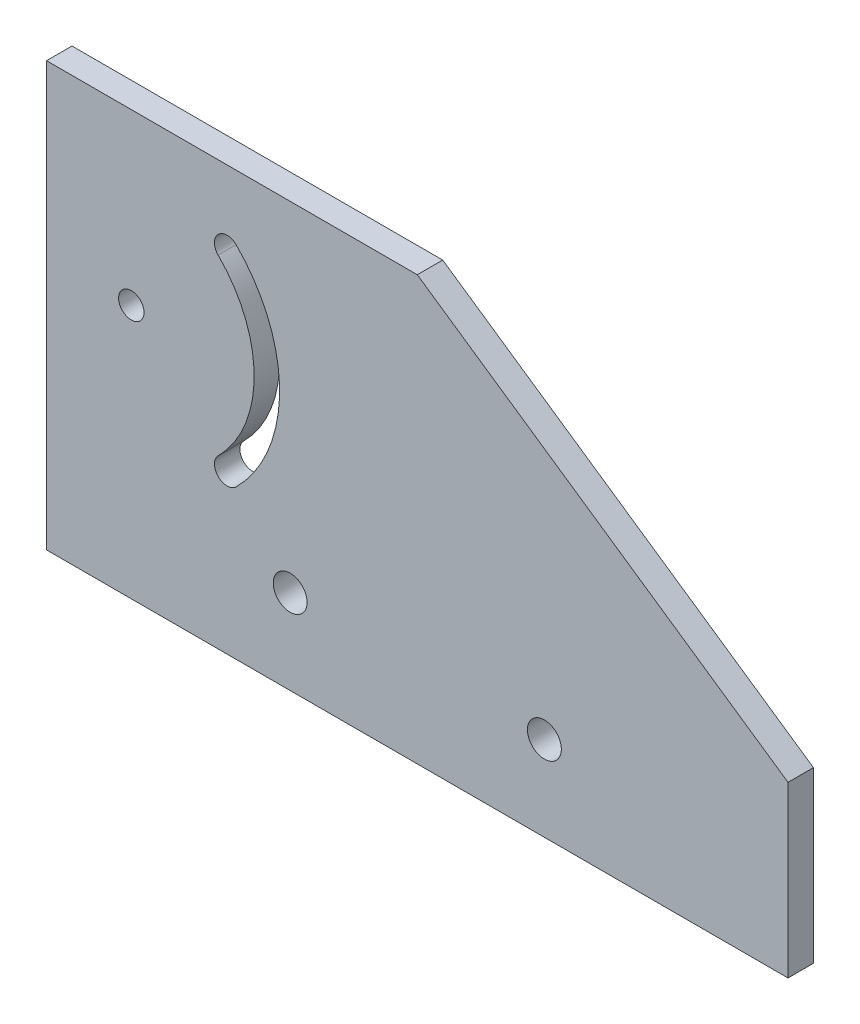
ISO-10303-21;
HEADER;
FILE_DESCRIPTION(('STEP AP214'),'2;1');
FILE_NAME('part.step','',(''),(''),'','','');
FILE_SCHEMA(('AUTOMOTIVE_DESIGN { 1 0 10303 214 1 1 1 1 }'));
ENDSEC;
DATA;
#1=APPLICATION_CONTEXT('core data for automotive mechanical design processes');
#2=APPLICATION_PROTOCOL_DEFINITION('international standard','automotive_design',2000,#1);
#3=PRODUCT_CONTEXT('',#1,'mechanical');
#4=PRODUCT('Part','Part','',(#3));
#5=PRODUCT_RELATED_PRODUCT_CATEGORY('part','',(#4));
#6=PRODUCT_DEFINITION_FORMATION('','',#4);
#7=PRODUCT_DEFINITION_CONTEXT('part definition',#1,'design');
#8=PRODUCT_DEFINITION('design','',#6,#7);
#9=PRODUCT_DEFINITION_SHAPE('','',#8);
#10=(LENGTH_UNIT() NAMED_UNIT(*) SI_UNIT(.MILLI.,.METRE.));
#11=(NAMED_UNIT(*) PLANE_ANGLE_UNIT() SI_UNIT($,.RADIAN.));
#12=(NAMED_UNIT(*) SI_UNIT($,.STERADIAN.) SOLID_ANGLE_UNIT());
#13=UNCERTAINTY_MEASURE_WITH_UNIT(LENGTH_MEASURE(1.E-05),#10,'distance_accuracy_value','');
#14=(GEOMETRIC_REPRESENTATION_CONTEXT(3) GLOBAL_UNCERTAINTY_ASSIGNED_CONTEXT((#13)) GLOBAL_UNIT_ASSIGNED_CONTEXT((#10,
#11,#12)) REPRESENTATION_CONTEXT('',''));
#15=CARTESIAN_POINT('',(0.,0.,0.));
#16=DIRECTION('',(0.,0.,1.));
#17=DIRECTION('',(1.,0.,0.));
#18=AXIS2_PLACEMENT_3D('',#15,#16,#17);
#19=CARTESIAN_POINT('',(43.75,25.,3.));
#20=DIRECTION('',(-1.,0.,0.));
#21=DIRECTION('',(0.,-1.,0.));
#22=AXIS2_PLACEMENT_3D('',#19,#20,#21);
#23=PLANE('',#22);
#24=DIRECTION('',(0.,1.,0.));
#25=VECTOR('',#24,1.);
#26=CARTESIAN_POINT('',(43.75,25.,0.));
#27=LINE('',#26,#25);
#28=CARTESIAN_POINT('',(43.75,-25.,0.));
#29=VERTEX_POINT('',#28);
#30=CARTESIAN_POINT('',(43.75,-4.99999999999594,0.));
#31=VERTEX_POINT('',#30);
#32=EDGE_CURVE('E156',#29,#31,#27,.T.);
#33=ORIENTED_EDGE('',*,*,#32,.T.);
#34=DIRECTION('',(0.,0.,1.));
#35=VECTOR('',#34,1.);
#36=CARTESIAN_POINT('',(43.7499999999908,-4.99999999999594,-7.));
#37=LINE('',#36,#35);
#38=CARTESIAN_POINT('',(43.7499999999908,-4.99999999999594,3.));
#39=VERTEX_POINT('',#38);
#40=EDGE_CURVE('E139',#31,#39,#37,.T.);
#41=ORIENTED_EDGE('',*,*,#40,.T.);
#42=DIRECTION('',(0.,1.,0.));
#43=VECTOR('',#42,1.);
#44=CARTESIAN_POINT('',(43.75,25.,3.));
#45=LINE('',#44,#43);
#46=CARTESIAN_POINT('',(43.75,-25.,3.));
#47=VERTEX_POINT('',#46);
#48=EDGE_CURVE('E157',#47,#39,#45,.T.);
#49=ORIENTED_EDGE('',*,*,#48,.F.);
#50=DIRECTION('',(0.,0.,-1.));
#51=VECTOR('',#50,1.);
#52=CARTESIAN_POINT('',(43.75,-25.,3.));
#53=LINE('',#52,#51);
#54=EDGE_CURVE('E167',#47,#29,#53,.T.);
#55=ORIENTED_EDGE('',*,*,#54,.T.);
#56=EDGE_LOOP('',(#33,#41,#49,#55));
#57=FACE_BOUND('',#56,.T.);
#58=ADVANCED_FACE('F35',(#57),#23,.F.);
#59=CARTESIAN_POINT('',(-43.75,25.,3.));
#60=DIRECTION('',(0.,-1.,0.));
#61=DIRECTION('',(0.,0.,-1.));
#62=AXIS2_PLACEMENT_3D('',#59,#60,#61);
#63=PLANE('',#62);
#64=DIRECTION('',(-1.,0.,0.));
#65=VECTOR('',#64,1.);
#66=CARTESIAN_POINT('',(-43.75,25.,3.));
#67=LINE('',#66,#65);
#68=CARTESIAN_POINT('',(0.,25.,3.));
#69=VERTEX_POINT('',#68);
#70=CARTESIAN_POINT('',(-43.75,25.,3.));
#71=VERTEX_POINT('',#70);
#72=EDGE_CURVE('E160',#69,#71,#67,.T.);
#73=ORIENTED_EDGE('',*,*,#72,.F.);
#74=DIRECTION('',(0.,0.,1.));
#75=VECTOR('',#74,1.);
#76=CARTESIAN_POINT('',(0.,25.,-7.));
#77=LINE('',#76,#75);
#78=CARTESIAN_POINT('',(0.,25.,0.));
#79=VERTEX_POINT('',#78);
#80=EDGE_CURVE('E140',#79,#69,#77,.T.);
#81=ORIENTED_EDGE('',*,*,#80,.F.);
#82=DIRECTION('',(-1.,0.,0.));
#83=VECTOR('',#82,1.);
#84=CARTESIAN_POINT('',(-43.75,25.,0.));
#85=LINE('',#84,#83);
#86=CARTESIAN_POINT('',(-43.75,25.,0.));
#87=VERTEX_POINT('',#86);
#88=EDGE_CURVE('E170',#79,#87,#85,.T.);
#89=ORIENTED_EDGE('',*,*,#88,.T.);
#90=DIRECTION('',(0.,0.,-1.));
#91=VECTOR('',#90,1.);
#92=CARTESIAN_POINT('',(-43.75,25.,3.));
#93=LINE('',#92,#91);
#94=EDGE_CURVE('E180',#71,#87,#93,.T.);
#95=ORIENTED_EDGE('',*,*,#94,.F.);
#96=EDGE_LOOP('',(#73,#81,#89,#95));
#97=FACE_BOUND('',#96,.T.);
#98=ADVANCED_FACE('F211',(#97),#63,.F.);
#99=CARTESIAN_POINT('',(-43.75,25.,3.));
#100=DIRECTION('',(1.,0.,0.));
#101=DIRECTION('',(0.,1.,0.));
#102=AXIS2_PLACEMENT_3D('',#99,#100,#101);
#103=PLANE('',#102);
#104=DIRECTION('',(0.,-1.,0.));
#105=VECTOR('',#104,1.);
#106=CARTESIAN_POINT('',(-43.75,25.,0.));
#107=LINE('',#106,#105);
#108=CARTESIAN_POINT('',(-43.75,-25.,0.));
#109=VERTEX_POINT('',#108);
#110=EDGE_CURVE('E172',#87,#109,#107,.T.);
#111=ORIENTED_EDGE('',*,*,#110,.T.);
#112=DIRECTION('',(0.,0.,-1.));
#113=VECTOR('',#112,1.);
#114=CARTESIAN_POINT('',(-43.75,-25.,3.));
#115=LINE('',#114,#113);
#116=CARTESIAN_POINT('',(-43.75,-25.,3.));
#117=VERTEX_POINT('',#116);
#118=EDGE_CURVE('E177',#117,#109,#115,.T.);
#119=ORIENTED_EDGE('',*,*,#118,.F.);
#120=DIRECTION('',(0.,-1.,0.));
#121=VECTOR('',#120,1.);
#122=CARTESIAN_POINT('',(-43.75,25.,3.));
#123=LINE('',#122,#121);
#124=EDGE_CURVE('E163',#71,#117,#123,.T.);
#125=ORIENTED_EDGE('',*,*,#124,.F.);
#126=ORIENTED_EDGE('',*,*,#94,.T.);
#127=EDGE_LOOP('',(#111,#119,#125,#126));
#128=FACE_BOUND('',#127,.T.);
#129=ADVANCED_FACE('F216',(#128),#103,.F.);
#130=CARTESIAN_POINT('',(-43.75,-25.,3.));
#131=DIRECTION('',(0.,1.,0.));
#132=DIRECTION('',(0.,0.,1.));
#133=AXIS2_PLACEMENT_3D('',#130,#131,#132);
#134=PLANE('',#133);
#135=DIRECTION('',(1.,0.,0.));
#136=VECTOR('',#135,1.);
#137=CARTESIAN_POINT('',(-43.75,-25.,0.));
#138=LINE('',#137,#136);
#139=EDGE_CURVE('E161',#109,#29,#138,.T.);
#140=ORIENTED_EDGE('',*,*,#139,.T.);
#141=ORIENTED_EDGE('',*,*,#54,.F.);
#142=DIRECTION('',(1.,0.,0.));
#143=VECTOR('',#142,1.);
#144=CARTESIAN_POINT('',(-43.75,-25.,3.));
#145=LINE('',#144,#143);
#146=EDGE_CURVE('E165',#117,#47,#145,.T.);
#147=ORIENTED_EDGE('',*,*,#146,.F.);
#148=ORIENTED_EDGE('',*,*,#118,.T.);
#149=EDGE_LOOP('',(#140,#141,#147,#148));
#150=FACE_BOUND('',#149,.T.);
#151=ADVANCED_FACE('F236',(#150),#134,.F.);
#152=CARTESIAN_POINT('',(0.,0.,3.));
#153=DIRECTION('',(0.,0.,1.));
#154=DIRECTION('',(1.,0.,0.));
#155=AXIS2_PLACEMENT_3D('',#152,#153,#154);
#156=PLANE('',#155);
#157=CARTESIAN_POINT('',(-22.4362915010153,-6.31370849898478,3.));
#158=DIRECTION('',(0.,0.,1.));
#159=DIRECTION('',(1.,0.,0.));
#160=AXIS2_PLACEMENT_3D('',#157,#158,#159);
#161=CIRCLE('',#160,1.5);
#162=CARTESIAN_POINT('',(-23.4969516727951,-5.25304832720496,3.));
#163=VERTEX_POINT('',#162);
#164=CARTESIAN_POINT('',(-21.3756313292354,-7.3743686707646,3.));
#165=VERTEX_POINT('',#164);
#166=EDGE_CURVE('E49',#163,#165,#161,.T.);
#167=ORIENTED_EDGE('',*,*,#166,.F.);
#168=CARTESIAN_POINT('',(-33.75,5.,3.));
#169=DIRECTION('',(0.,0.,-1.));
#170=DIRECTION('',(1.,0.,0.));
#171=AXIS2_PLACEMENT_3D('',#168,#169,#170);
#172=CIRCLE('',#171,14.5);
#173=CARTESIAN_POINT('',(-23.4969516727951,15.2530483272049,3.));
#174=VERTEX_POINT('',#173);
#175=EDGE_CURVE('E124',#174,#163,#172,.T.);
#176=ORIENTED_EDGE('',*,*,#175,.F.);
#177=CARTESIAN_POINT('',(-22.4362915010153,16.3137084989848,3.));
#178=DIRECTION('',(0.,0.,1.));
#179=DIRECTION('',(1.,0.,0.));
#180=AXIS2_PLACEMENT_3D('',#177,#178,#179);
#181=CIRCLE('',#180,1.5);
#182=CARTESIAN_POINT('',(-21.3756313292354,17.3743686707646,3.));
#183=VERTEX_POINT('',#182);
#184=EDGE_CURVE('E108',#183,#174,#181,.T.);
#185=ORIENTED_EDGE('',*,*,#184,.F.);
#186=CARTESIAN_POINT('',(-33.75,5.,3.));
#187=DIRECTION('',(0.,0.,1.));
#188=DIRECTION('',(1.,0.,0.));
#189=AXIS2_PLACEMENT_3D('',#186,#187,#188);
#190=CIRCLE('',#189,17.5);
#191=EDGE_CURVE('E117',#165,#183,#190,.T.);
#192=ORIENTED_EDGE('',*,*,#191,.F.);
#193=EDGE_LOOP('',(#167,#176,#185,#192));
#194=FACE_BOUND('',#193,.T.);
#195=CARTESIAN_POINT('',(-33.75,5.,3.));
#196=DIRECTION('',(0.,0.,1.));
#197=DIRECTION('',(1.,0.,0.));
#198=AXIS2_PLACEMENT_3D('',#195,#196,#197);
#199=CIRCLE('',#198,1.5);
#200=CARTESIAN_POINT('',(-32.25,5.,3.));
#201=VERTEX_POINT('',#200);
#202=EDGE_CURVE('E131',#201,#201,#199,.T.);
#203=ORIENTED_EDGE('',*,*,#202,.F.);
#204=EDGE_LOOP('',(#203));
#205=FACE_BOUND('',#204,.T.);
#206=DIRECTION('',(0.824728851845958,-0.565528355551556,0.));
#207=VECTOR('',#206,1.);
#208=CARTESIAN_POINT('',(43.7499999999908,-4.99999999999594,3.));
#209=LINE('',#208,#207);
#210=EDGE_CURVE('E137',#69,#39,#209,.T.);
#211=ORIENTED_EDGE('',*,*,#210,.F.);
#212=ORIENTED_EDGE('',*,*,#72,.T.);
#213=ORIENTED_EDGE('',*,*,#124,.T.);
#214=ORIENTED_EDGE('',*,*,#146,.T.);
#215=ORIENTED_EDGE('',*,*,#48,.T.);
#216=EDGE_LOOP('',(#211,#212,#213,#214,#215));
#217=FACE_BOUND('',#216,.T.);
#218=CARTESIAN_POINT('',(-15.,-15.,3.));
#219=DIRECTION('',(0.,0.,1.));
#220=DIRECTION('',(1.,0.,0.));
#221=AXIS2_PLACEMENT_3D('',#218,#219,#220);
#222=CIRCLE('',#221,1.99999999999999);
#223=CARTESIAN_POINT('',(-13.,-15.,3.));
#224=VERTEX_POINT('',#223);
#225=EDGE_CURVE('E142',#224,#224,#222,.T.);
#226=ORIENTED_EDGE('',*,*,#225,.F.);
#227=EDGE_LOOP('',(#226));
#228=FACE_BOUND('',#227,.T.);
#229=CARTESIAN_POINT('',(15.,-15.,3.));
#230=DIRECTION('',(0.,0.,1.));
#231=DIRECTION('',(1.,0.,0.));
#232=AXIS2_PLACEMENT_3D('',#229,#230,#231);
#233=CIRCLE('',#232,1.99999999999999);
#234=CARTESIAN_POINT('',(17.,-15.,3.));
#235=VERTEX_POINT('',#234);
#236=EDGE_CURVE('E150',#235,#235,#233,.T.);
#237=ORIENTED_EDGE('',*,*,#236,.F.);
#238=EDGE_LOOP('',(#237));
#239=FACE_BOUND('',#238,.T.);
#240=ADVANCED_FACE('F121',(#194,#205,#217,#228,#239),#156,.T.);
#241=CARTESIAN_POINT('',(0.,0.,0.));
#242=DIRECTION('',(0.,0.,1.));
#243=DIRECTION('',(1.,0.,0.));
#244=AXIS2_PLACEMENT_3D('',#241,#242,#243);
#245=PLANE('',#244);
#246=CARTESIAN_POINT('',(-33.75,5.,0.));
#247=DIRECTION('',(0.,0.,1.));
#248=DIRECTION('',(1.,0.,0.));
#249=AXIS2_PLACEMENT_3D('',#246,#247,#248);
#250=CIRCLE('',#249,14.5);
#251=CARTESIAN_POINT('',(-23.4969516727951,15.2530483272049,0.));
#252=VERTEX_POINT('',#251);
#253=CARTESIAN_POINT('',(-23.4969516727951,-5.25304832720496,0.));
#254=VERTEX_POINT('',#253);
#255=EDGE_CURVE('E42',#252,#254,#250,.F.);
#256=ORIENTED_EDGE('',*,*,#255,.T.);
#257=CARTESIAN_POINT('',(-22.4362915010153,-6.31370849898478,0.));
#258=DIRECTION('',(0.,0.,1.));
#259=DIRECTION('',(1.,0.,0.));
#260=AXIS2_PLACEMENT_3D('',#257,#258,#259);
#261=CIRCLE('',#260,1.5);
#262=CARTESIAN_POINT('',(-21.3756313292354,-7.3743686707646,0.));
#263=VERTEX_POINT('',#262);
#264=EDGE_CURVE('E11',#254,#263,#261,.T.);
#265=ORIENTED_EDGE('',*,*,#264,.T.);
#266=CARTESIAN_POINT('',(-33.75,5.,0.));
#267=DIRECTION('',(0.,0.,1.));
#268=DIRECTION('',(1.,0.,0.));
#269=AXIS2_PLACEMENT_3D('',#266,#267,#268);
#270=CIRCLE('',#269,17.5);
#271=CARTESIAN_POINT('',(-21.3756313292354,17.3743686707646,0.));
#272=VERTEX_POINT('',#271);
#273=EDGE_CURVE('E186',#263,#272,#270,.T.);
#274=ORIENTED_EDGE('',*,*,#273,.T.);
#275=CARTESIAN_POINT('',(-22.4362915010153,16.3137084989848,0.));
#276=DIRECTION('',(0.,0.,1.));
#277=DIRECTION('',(1.,0.,0.));
#278=AXIS2_PLACEMENT_3D('',#275,#276,#277);
#279=CIRCLE('',#278,1.5);
#280=EDGE_CURVE('E111',#272,#252,#279,.T.);
#281=ORIENTED_EDGE('',*,*,#280,.T.);
#282=EDGE_LOOP('',(#256,#265,#274,#281));
#283=FACE_BOUND('',#282,.T.);
#284=CARTESIAN_POINT('',(-33.75,5.,0.));
#285=DIRECTION('',(0.,0.,1.));
#286=DIRECTION('',(1.,0.,0.));
#287=AXIS2_PLACEMENT_3D('',#284,#285,#286);
#288=CIRCLE('',#287,1.5);
#289=CARTESIAN_POINT('',(-32.25,5.,0.));
#290=VERTEX_POINT('',#289);
#291=EDGE_CURVE('E136',#290,#290,#288,.T.);
#292=ORIENTED_EDGE('',*,*,#291,.T.);
#293=EDGE_LOOP('',(#292));
#294=FACE_BOUND('',#293,.T.);
#295=CARTESIAN_POINT('',(-15.,-15.,0.));
#296=DIRECTION('',(0.,0.,1.));
#297=DIRECTION('',(1.,0.,0.));
#298=AXIS2_PLACEMENT_3D('',#295,#296,#297);
#299=CIRCLE('',#298,2.);
#300=CARTESIAN_POINT('',(-13.,-15.,0.));
#301=VERTEX_POINT('',#300);
#302=EDGE_CURVE('E147',#301,#301,#299,.T.);
#303=ORIENTED_EDGE('',*,*,#302,.T.);
#304=EDGE_LOOP('',(#303));
#305=FACE_BOUND('',#304,.T.);
#306=CARTESIAN_POINT('',(15.,-15.,0.));
#307=DIRECTION('',(0.,0.,1.));
#308=DIRECTION('',(1.,0.,0.));
#309=AXIS2_PLACEMENT_3D('',#306,#307,#308);
#310=CIRCLE('',#309,2.);
#311=CARTESIAN_POINT('',(17.,-15.,0.));
#312=VERTEX_POINT('',#311);
#313=EDGE_CURVE('E153',#312,#312,#310,.T.);
#314=ORIENTED_EDGE('',*,*,#313,.T.);
#315=EDGE_LOOP('',(#314));
#316=FACE_BOUND('',#315,.T.);
#317=ORIENTED_EDGE('',*,*,#88,.F.);
#318=DIRECTION('',(0.824728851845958,-0.565528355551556,0.));
#319=VECTOR('',#318,1.);
#320=CARTESIAN_POINT('',(11.6601887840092,17.0044419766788,0.));
#321=LINE('',#320,#319);
#322=EDGE_CURVE('E183',#79,#31,#321,.T.);
#323=ORIENTED_EDGE('',*,*,#322,.T.);
#324=ORIENTED_EDGE('',*,*,#32,.F.);
#325=ORIENTED_EDGE('',*,*,#139,.F.);
#326=ORIENTED_EDGE('',*,*,#110,.F.);
#327=EDGE_LOOP('',(#317,#323,#324,#325,#326));
#328=FACE_BOUND('',#327,.T.);
#329=ADVANCED_FACE('F192',(#283,#294,#305,#316,#328),#245,.F.);
#330=CARTESIAN_POINT('',(15.,-15.,3.));
#331=DIRECTION('',(0.,0.,1.));
#332=DIRECTION('',(1.,0.,0.));
#333=AXIS2_PLACEMENT_3D('',#330,#331,#332);
#334=CYLINDRICAL_SURFACE('',#333,1.99999999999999);
#335=ORIENTED_EDGE('',*,*,#313,.F.);
#336=EDGE_LOOP('',(#335));
#337=FACE_BOUND('',#336,.T.);
#338=ORIENTED_EDGE('',*,*,#236,.T.);
#339=EDGE_LOOP('',(#338));
#340=FACE_BOUND('',#339,.T.);
#341=ADVANCED_FACE('F247',(#337,#340),#334,.F.);
#342=CARTESIAN_POINT('',(-15.,-15.,3.));
#343=DIRECTION('',(0.,0.,1.));
#344=DIRECTION('',(1.,0.,0.));
#345=AXIS2_PLACEMENT_3D('',#342,#343,#344);
#346=CYLINDRICAL_SURFACE('',#345,1.99999999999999);
#347=ORIENTED_EDGE('',*,*,#302,.F.);
#348=EDGE_LOOP('',(#347));
#349=FACE_BOUND('',#348,.T.);
#350=ORIENTED_EDGE('',*,*,#225,.T.);
#351=EDGE_LOOP('',(#350));
#352=FACE_BOUND('',#351,.T.);
#353=ADVANCED_FACE('F252',(#349,#352),#346,.F.);
#354=CARTESIAN_POINT('',(43.7499999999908,-4.99999999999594,-7.));
#355=DIRECTION('',(-0.565528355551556,-0.824728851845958,0.));
#356=DIRECTION('',(0.824728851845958,-0.565528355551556,0.));
#357=AXIS2_PLACEMENT_3D('',#354,#355,#356);
#358=PLANE('',#357);
#359=ORIENTED_EDGE('',*,*,#80,.T.);
#360=ORIENTED_EDGE('',*,*,#210,.T.);
#361=ORIENTED_EDGE('',*,*,#40,.F.);
#362=ORIENTED_EDGE('',*,*,#322,.F.);
#363=EDGE_LOOP('',(#359,#360,#361,#362));
#364=FACE_BOUND('',#363,.T.);
#365=ADVANCED_FACE('F206',(#364),#358,.F.);
#366=CARTESIAN_POINT('',(-33.75,5.,-21.));
#367=DIRECTION('',(0.,0.,1.));
#368=DIRECTION('',(1.,0.,0.));
#369=AXIS2_PLACEMENT_3D('',#366,#367,#368);
#370=CYLINDRICAL_SURFACE('',#369,1.5);
#371=ORIENTED_EDGE('',*,*,#202,.T.);
#372=EDGE_LOOP('',(#371));
#373=FACE_BOUND('',#372,.T.);
#374=ORIENTED_EDGE('',*,*,#291,.F.);
#375=EDGE_LOOP('',(#374));
#376=FACE_BOUND('',#375,.T.);
#377=ADVANCED_FACE('F199',(#373,#376),#370,.F.);
#378=CARTESIAN_POINT('',(-22.4362915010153,-6.31370849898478,-21.));
#379=DIRECTION('',(0.,0.,1.));
#380=DIRECTION('',(1.,0.,0.));
#381=AXIS2_PLACEMENT_3D('',#378,#379,#380);
#382=CYLINDRICAL_SURFACE('',#381,1.5);
#383=DIRECTION('',(0.,0.,1.));
#384=VECTOR('',#383,1.);
#385=CARTESIAN_POINT('',(-23.4969516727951,-5.25304832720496,-21.));
#386=LINE('',#385,#384);
#387=EDGE_CURVE('E129',#254,#163,#386,.T.);
#388=ORIENTED_EDGE('',*,*,#387,.T.);
#389=ORIENTED_EDGE('',*,*,#166,.T.);
#390=DIRECTION('',(0.,0.,1.));
#391=VECTOR('',#390,1.);
#392=CARTESIAN_POINT('',(-21.3756313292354,-7.3743686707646,-21.));
#393=LINE('',#392,#391);
#394=EDGE_CURVE('E114',#263,#165,#393,.T.);
#395=ORIENTED_EDGE('',*,*,#394,.F.);
#396=ORIENTED_EDGE('',*,*,#264,.F.);
#397=EDGE_LOOP('',(#388,#389,#395,#396));
#398=FACE_BOUND('',#397,.T.);
#399=ADVANCED_FACE('F197',(#398),#382,.F.);
#400=CARTESIAN_POINT('',(-33.75,5.,-21.));
#401=DIRECTION('',(0.,0.,1.));
#402=DIRECTION('',(1.,0.,0.));
#403=AXIS2_PLACEMENT_3D('',#400,#401,#402);
#404=CYLINDRICAL_SURFACE('',#403,14.5);
#405=DIRECTION('',(0.,0.,1.));
#406=VECTOR('',#405,1.);
#407=CARTESIAN_POINT('',(-23.4969516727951,15.2530483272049,-21.));
#408=LINE('',#407,#406);
#409=EDGE_CURVE('E113',#252,#174,#408,.T.);
#410=ORIENTED_EDGE('',*,*,#409,.T.);
#411=ORIENTED_EDGE('',*,*,#175,.T.);
#412=ORIENTED_EDGE('',*,*,#387,.F.);
#413=ORIENTED_EDGE('',*,*,#255,.F.);
#414=EDGE_LOOP('',(#410,#411,#412,#413));
#415=FACE_BOUND('',#414,.T.);
#416=ADVANCED_FACE('F196',(#415),#404,.T.);
#417=CARTESIAN_POINT('',(-22.4362915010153,16.3137084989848,-21.));
#418=DIRECTION('',(0.,0.,1.));
#419=DIRECTION('',(1.,0.,0.));
#420=AXIS2_PLACEMENT_3D('',#417,#418,#419);
#421=CYLINDRICAL_SURFACE('',#420,1.5);
#422=DIRECTION('',(0.,0.,1.));
#423=VECTOR('',#422,1.);
#424=CARTESIAN_POINT('',(-21.3756313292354,17.3743686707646,-21.));
#425=LINE('',#424,#423);
#426=EDGE_CURVE('E57',#272,#183,#425,.T.);
#427=ORIENTED_EDGE('',*,*,#426,.T.);
#428=ORIENTED_EDGE('',*,*,#184,.T.);
#429=ORIENTED_EDGE('',*,*,#409,.F.);
#430=ORIENTED_EDGE('',*,*,#280,.F.);
#431=EDGE_LOOP('',(#427,#428,#429,#430));
#432=FACE_BOUND('',#431,.T.);
#433=ADVANCED_FACE('F105',(#432),#421,.F.);
#434=CARTESIAN_POINT('',(-33.75,5.,-21.));
#435=DIRECTION('',(0.,0.,1.));
#436=DIRECTION('',(1.,0.,0.));
#437=AXIS2_PLACEMENT_3D('',#434,#435,#436);
#438=CYLINDRICAL_SURFACE('',#437,17.5);
#439=ORIENTED_EDGE('',*,*,#394,.T.);
#440=ORIENTED_EDGE('',*,*,#191,.T.);
#441=ORIENTED_EDGE('',*,*,#426,.F.);
#442=ORIENTED_EDGE('',*,*,#273,.F.);
#443=EDGE_LOOP('',(#439,#440,#441,#442));
#444=FACE_BOUND('',#443,.T.);
#445=ADVANCED_FACE('F118',(#444),#438,.F.);
#446=CLOSED_SHELL('',(#58,#98,#129,#151,#240,#329,#341,#353,#365,#377,#399,#416,#433,#445));
#447=MANIFOLD_SOLID_BREP('B2',#446);
#448=ADVANCED_BREP_SHAPE_REPRESENTATION('',(#18,#447),#14);
#449=SHAPE_DEFINITION_REPRESENTATION(#9,#448);
ENDSEC;
END-ISO-10303-21;
